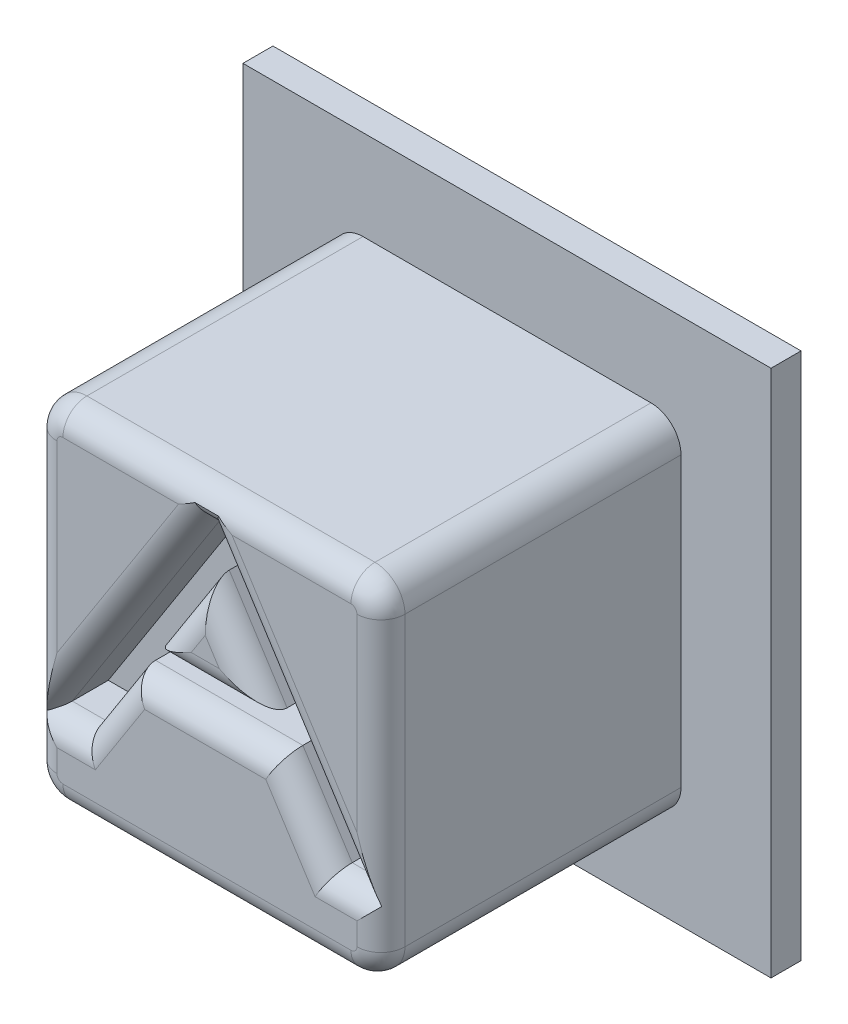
ISO-10303-21;
HEADER;
FILE_DESCRIPTION(('STEP AP214'),'2;1');
FILE_NAME('part.step','',(''),(''),'','','');
FILE_SCHEMA(('AUTOMOTIVE_DESIGN { 1 0 10303 214 1 1 1 1 }'));
ENDSEC;
DATA;
#1=APPLICATION_CONTEXT('core data for automotive mechanical design processes');
#2=APPLICATION_PROTOCOL_DEFINITION('international standard','automotive_design',2000,#1);
#3=PRODUCT_CONTEXT('',#1,'mechanical');
#4=PRODUCT('Part','Part','',(#3));
#5=PRODUCT_RELATED_PRODUCT_CATEGORY('part','',(#4));
#6=PRODUCT_DEFINITION_FORMATION('','',#4);
#7=PRODUCT_DEFINITION_CONTEXT('part definition',#1,'design');
#8=PRODUCT_DEFINITION('design','',#6,#7);
#9=PRODUCT_DEFINITION_SHAPE('','',#8);
#10=(LENGTH_UNIT() NAMED_UNIT(*) SI_UNIT(.MILLI.,.METRE.));
#11=(NAMED_UNIT(*) PLANE_ANGLE_UNIT() SI_UNIT($,.RADIAN.));
#12=(NAMED_UNIT(*) SI_UNIT($,.STERADIAN.) SOLID_ANGLE_UNIT());
#13=UNCERTAINTY_MEASURE_WITH_UNIT(LENGTH_MEASURE(1.E-05),#10,'distance_accuracy_value','');
#14=(GEOMETRIC_REPRESENTATION_CONTEXT(3) GLOBAL_UNCERTAINTY_ASSIGNED_CONTEXT((#13)) GLOBAL_UNIT_ASSIGNED_CONTEXT((#10,
#11,#12)) REPRESENTATION_CONTEXT('',''));
#15=CARTESIAN_POINT('',(0.,0.,0.));
#16=DIRECTION('',(0.,0.,1.));
#17=DIRECTION('',(1.,0.,0.));
#18=AXIS2_PLACEMENT_3D('',#15,#16,#17);
#19=CARTESIAN_POINT('',(0.,0.,5.));
#20=DIRECTION('',(0.,0.,1.));
#21=DIRECTION('',(1.,0.,0.));
#22=AXIS2_PLACEMENT_3D('',#19,#20,#21);
#23=PLANE('',#22);
#24=CARTESIAN_POINT('',(2.4,-2.4,5.));
#25=DIRECTION('',(0.,0.,1.));
#26=DIRECTION('',(1.,0.,0.));
#27=AXIS2_PLACEMENT_3D('',#24,#25,#26);
#28=CIRCLE('',#27,0.1);
#29=CARTESIAN_POINT('',(2.5,-2.4,5.));
#30=VERTEX_POINT('',#29);
#31=CARTESIAN_POINT('',(2.4,-2.5,5.));
#32=VERTEX_POINT('',#31);
#33=EDGE_CURVE('E526',#30,#32,#28,.F.);
#34=ORIENTED_EDGE('',*,*,#33,.F.);
#35=DIRECTION('',(0.,1.,0.));
#36=VECTOR('',#35,1.);
#37=CARTESIAN_POINT('',(2.5,2.9,5.));
#38=LINE('',#37,#36);
#39=CARTESIAN_POINT('',(2.5,-2.02552532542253,5.));
#40=VERTEX_POINT('',#39);
#41=EDGE_CURVE('E417',#30,#40,#38,.T.);
#42=ORIENTED_EDGE('',*,*,#41,.T.);
#43=DIRECTION('',(-1.,0.,0.));
#44=VECTOR('',#43,1.);
#45=CARTESIAN_POINT('',(0.,-2.02552532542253,5.));
#46=LINE('',#45,#44);
#47=CARTESIAN_POINT('',(1.80279833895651,-2.02552532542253,5.));
#48=VERTEX_POINT('',#47);
#49=EDGE_CURVE('E422',#40,#48,#46,.T.);
#50=ORIENTED_EDGE('',*,*,#49,.T.);
#51=DIRECTION('',(-0.539799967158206,0.841793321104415,0.));
#52=VECTOR('',#51,1.);
#53=CARTESIAN_POINT('',(0.357093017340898,0.228985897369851,5.));
#54=LINE('',#53,#52);
#55=CARTESIAN_POINT('',(0.980682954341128,-0.743474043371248,5.));
#56=VERTEX_POINT('',#55);
#57=EDGE_CURVE('E424',#48,#56,#54,.T.);
#58=ORIENTED_EDGE('',*,*,#57,.T.);
#59=DIRECTION('',(-1.,0.,0.));
#60=VECTOR('',#59,1.);
#61=CARTESIAN_POINT('',(0.,-0.743474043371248,5.));
#62=LINE('',#61,#60);
#63=CARTESIAN_POINT('',(-1.03777939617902,-0.743474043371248,5.));
#64=VERTEX_POINT('',#63);
#65=EDGE_CURVE('E426',#56,#64,#62,.T.);
#66=ORIENTED_EDGE('',*,*,#65,.T.);
#67=DIRECTION('',(-0.539426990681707,-0.842032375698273,0.));
#68=VECTOR('',#67,1.);
#69=CARTESIAN_POINT('',(-0.398107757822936,0.255037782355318,5.));
#70=LINE('',#69,#68);
#71=CARTESIAN_POINT('',(-1.85909349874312,-2.02552532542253,5.));
#72=VERTEX_POINT('',#71);
#73=EDGE_CURVE('E428',#64,#72,#70,.T.);
#74=ORIENTED_EDGE('',*,*,#73,.T.);
#75=DIRECTION('',(-1.,0.,0.));
#76=VECTOR('',#75,1.);
#77=CARTESIAN_POINT('',(0.,-2.02552532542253,5.));
#78=LINE('',#77,#76);
#79=CARTESIAN_POINT('',(-2.5,-2.02552532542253,5.));
#80=VERTEX_POINT('',#79);
#81=EDGE_CURVE('E430',#72,#80,#78,.T.);
#82=ORIENTED_EDGE('',*,*,#81,.T.);
#83=DIRECTION('',(0.,-1.,0.));
#84=VECTOR('',#83,1.);
#85=CARTESIAN_POINT('',(-2.5,-2.9,5.));
#86=LINE('',#85,#84);
#87=CARTESIAN_POINT('',(-2.5,-2.4,5.));
#88=VERTEX_POINT('',#87);
#89=EDGE_CURVE('E433',#80,#88,#86,.T.);
#90=ORIENTED_EDGE('',*,*,#89,.T.);
#91=CARTESIAN_POINT('',(-2.4,-2.4,5.));
#92=DIRECTION('',(0.,0.,1.));
#93=DIRECTION('',(1.,0.,0.));
#94=AXIS2_PLACEMENT_3D('',#91,#92,#93);
#95=CIRCLE('',#94,0.1);
#96=CARTESIAN_POINT('',(-2.4,-2.5,5.));
#97=VERTEX_POINT('',#96);
#98=EDGE_CURVE('E523',#97,#88,#95,.F.);
#99=ORIENTED_EDGE('',*,*,#98,.F.);
#100=DIRECTION('',(1.,0.,0.));
#101=VECTOR('',#100,1.);
#102=CARTESIAN_POINT('',(2.9,-2.5,5.));
#103=LINE('',#102,#101);
#104=EDGE_CURVE('E419',#97,#32,#103,.T.);
#105=ORIENTED_EDGE('',*,*,#104,.T.);
#106=EDGE_LOOP('',(#34,#42,#50,#58,#66,#74,#82,#90,#99,#105));
#107=FACE_BOUND('',#106,.T.);
#108=ADVANCED_FACE('F37',(#107),#23,.T.);
#109=CARTESIAN_POINT('',(2.4,2.4,5.));
#110=DIRECTION('',(0.,0.,1.));
#111=DIRECTION('',(1.,0.,0.));
#112=AXIS2_PLACEMENT_3D('',#109,#110,#111);
#113=CIRCLE('',#112,0.1);
#114=CARTESIAN_POINT('',(2.4,2.5,5.));
#115=VERTEX_POINT('',#114);
#116=CARTESIAN_POINT('',(2.5,2.4,5.));
#117=VERTEX_POINT('',#116);
#118=EDGE_CURVE('E521',#115,#117,#113,.F.);
#119=ORIENTED_EDGE('',*,*,#118,.F.);
#120=DIRECTION('',(-1.,0.,0.));
#121=VECTOR('',#120,1.);
#122=CARTESIAN_POINT('',(-2.9,2.5,5.));
#123=LINE('',#122,#121);
#124=CARTESIAN_POINT('',(0.417739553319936,2.5,5.));
#125=VERTEX_POINT('',#124);
#126=EDGE_CURVE('E412',#115,#125,#123,.T.);
#127=ORIENTED_EDGE('',*,*,#126,.T.);
#128=DIRECTION('',(0.539666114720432,-0.841879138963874,0.));
#129=VECTOR('',#128,1.);
#130=CARTESIAN_POINT('',(1.43191139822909,0.917891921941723,5.));
#131=LINE('',#130,#129);
#132=CARTESIAN_POINT('',(2.5,-0.748326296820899,5.));
#133=VERTEX_POINT('',#132);
#134=EDGE_CURVE('E414',#125,#133,#131,.T.);
#135=ORIENTED_EDGE('',*,*,#134,.T.);
#136=DIRECTION('',(0.,1.,0.));
#137=VECTOR('',#136,1.);
#138=CARTESIAN_POINT('',(2.5,2.9,5.));
#139=LINE('',#138,#137);
#140=EDGE_CURVE('E401',#133,#117,#139,.T.);
#141=ORIENTED_EDGE('',*,*,#140,.T.);
#142=EDGE_LOOP('',(#119,#127,#135,#141));
#143=FACE_BOUND('',#142,.T.);
#144=ADVANCED_FACE('F604',(#143),#23,.T.);
#145=CARTESIAN_POINT('',(-2.4,2.4,5.));
#146=DIRECTION('',(0.,0.,1.));
#147=DIRECTION('',(1.,0.,0.));
#148=AXIS2_PLACEMENT_3D('',#145,#146,#147);
#149=CIRCLE('',#148,0.1);
#150=CARTESIAN_POINT('',(-2.5,2.4,5.));
#151=VERTEX_POINT('',#150);
#152=CARTESIAN_POINT('',(-2.4,2.5,5.));
#153=VERTEX_POINT('',#152);
#154=EDGE_CURVE('E514',#151,#153,#149,.F.);
#155=ORIENTED_EDGE('',*,*,#154,.F.);
#156=DIRECTION('',(0.,-1.,0.));
#157=VECTOR('',#156,1.);
#158=CARTESIAN_POINT('',(-2.5,-2.9,5.));
#159=LINE('',#158,#157);
#160=CARTESIAN_POINT('',(-2.5,-0.660326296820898,5.));
#161=VERTEX_POINT('',#160);
#162=EDGE_CURVE('E439',#151,#161,#159,.T.);
#163=ORIENTED_EDGE('',*,*,#162,.T.);
#164=DIRECTION('',(0.539666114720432,0.841879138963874,0.));
#165=VECTOR('',#164,1.);
#166=CARTESIAN_POINT('',(-1.4718927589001,0.943520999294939,5.));
#167=LINE('',#166,#165);
#168=CARTESIAN_POINT('',(-0.474149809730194,2.5,5.));
#169=VERTEX_POINT('',#168);
#170=EDGE_CURVE('E441',#161,#169,#167,.T.);
#171=ORIENTED_EDGE('',*,*,#170,.T.);
#172=DIRECTION('',(-1.,0.,0.));
#173=VECTOR('',#172,1.);
#174=CARTESIAN_POINT('',(-2.9,2.5,5.));
#175=LINE('',#174,#173);
#176=EDGE_CURVE('E436',#169,#153,#175,.T.);
#177=ORIENTED_EDGE('',*,*,#176,.T.);
#178=EDGE_LOOP('',(#155,#163,#171,#177));
#179=FACE_BOUND('',#178,.T.);
#180=ADVANCED_FACE('F610',(#179),#23,.T.);
#181=CARTESIAN_POINT('',(2.9,2.9,5.));
#182=DIRECTION('',(-1.,0.,0.));
#183=DIRECTION('',(0.,-1.,0.));
#184=AXIS2_PLACEMENT_3D('',#181,#182,#183);
#185=PLANE('',#184);
#186=DIRECTION('',(0.,1.,0.));
#187=VECTOR('',#186,1.);
#188=CARTESIAN_POINT('',(2.9,-2.9,4.6));
#189=LINE('',#188,#187);
#190=CARTESIAN_POINT('',(2.9,2.4,4.6));
#191=VERTEX_POINT('',#190);
#192=CARTESIAN_POINT('',(2.9,-2.4,4.6));
#193=VERTEX_POINT('',#192);
#194=EDGE_CURVE('E470',#191,#193,#189,.F.);
#195=ORIENTED_EDGE('',*,*,#194,.T.);
#196=DIRECTION('',(0.,0.,-1.));
#197=VECTOR('',#196,1.);
#198=CARTESIAN_POINT('',(2.9,-2.4,5.));
#199=LINE('',#198,#197);
#200=CARTESIAN_POINT('',(2.9,-2.4,0.));
#201=VERTEX_POINT('',#200);
#202=EDGE_CURVE('E547',#193,#201,#199,.T.);
#203=ORIENTED_EDGE('',*,*,#202,.T.);
#204=DIRECTION('',(0.,1.,0.));
#205=VECTOR('',#204,1.);
#206=CARTESIAN_POINT('',(2.9,2.9,0.));
#207=LINE('',#206,#205);
#208=CARTESIAN_POINT('',(2.9,2.4,0.));
#209=VERTEX_POINT('',#208);
#210=EDGE_CURVE('E371',#201,#209,#207,.T.);
#211=ORIENTED_EDGE('',*,*,#210,.T.);
#212=DIRECTION('',(0.,0.,-1.));
#213=VECTOR('',#212,1.);
#214=CARTESIAN_POINT('',(2.9,2.4,5.));
#215=LINE('',#214,#213);
#216=EDGE_CURVE('E545',#209,#191,#215,.F.);
#217=ORIENTED_EDGE('',*,*,#216,.T.);
#218=EDGE_LOOP('',(#195,#203,#211,#217));
#219=FACE_BOUND('',#218,.T.);
#220=ADVANCED_FACE('F627',(#219),#185,.F.);
#221=CARTESIAN_POINT('',(-2.9,2.9,5.));
#222=DIRECTION('',(0.,-1.,0.));
#223=DIRECTION('',(0.,0.,-1.));
#224=AXIS2_PLACEMENT_3D('',#221,#222,#223);
#225=PLANE('',#224);
#226=DIRECTION('',(-1.,0.,0.));
#227=VECTOR('',#226,1.);
#228=CARTESIAN_POINT('',(2.9,2.9,4.6));
#229=LINE('',#228,#227);
#230=CARTESIAN_POINT('',(-2.4,2.9,4.6));
#231=VERTEX_POINT('',#230);
#232=CARTESIAN_POINT('',(2.4,2.9,4.6));
#233=VERTEX_POINT('',#232);
#234=EDGE_CURVE('E467',#231,#233,#229,.F.);
#235=ORIENTED_EDGE('',*,*,#234,.T.);
#236=DIRECTION('',(0.,0.,-1.));
#237=VECTOR('',#236,1.);
#238=CARTESIAN_POINT('',(2.4,2.9,5.));
#239=LINE('',#238,#237);
#240=CARTESIAN_POINT('',(2.4,2.9,0.));
#241=VERTEX_POINT('',#240);
#242=EDGE_CURVE('E551',#233,#241,#239,.T.);
#243=ORIENTED_EDGE('',*,*,#242,.T.);
#244=DIRECTION('',(-1.,0.,0.));
#245=VECTOR('',#244,1.);
#246=CARTESIAN_POINT('',(-2.9,2.9,0.));
#247=LINE('',#246,#245);
#248=CARTESIAN_POINT('',(-2.4,2.9,0.));
#249=VERTEX_POINT('',#248);
#250=EDGE_CURVE('E374',#241,#249,#247,.T.);
#251=ORIENTED_EDGE('',*,*,#250,.T.);
#252=DIRECTION('',(0.,0.,-1.));
#253=VECTOR('',#252,1.);
#254=CARTESIAN_POINT('',(-2.4,2.9,5.));
#255=LINE('',#254,#253);
#256=EDGE_CURVE('E549',#249,#231,#255,.F.);
#257=ORIENTED_EDGE('',*,*,#256,.T.);
#258=EDGE_LOOP('',(#235,#243,#251,#257));
#259=FACE_BOUND('',#258,.T.);
#260=ADVANCED_FACE('F632',(#259),#225,.F.);
#261=CARTESIAN_POINT('',(-2.9,2.9,5.));
#262=DIRECTION('',(1.,0.,0.));
#263=DIRECTION('',(0.,1.,0.));
#264=AXIS2_PLACEMENT_3D('',#261,#262,#263);
#265=PLANE('',#264);
#266=DIRECTION('',(0.,-1.,0.));
#267=VECTOR('',#266,1.);
#268=CARTESIAN_POINT('',(-2.9,2.9,0.));
#269=LINE('',#268,#267);
#270=CARTESIAN_POINT('',(-2.9,2.4,0.));
#271=VERTEX_POINT('',#270);
#272=CARTESIAN_POINT('',(-2.9,-2.4,0.));
#273=VERTEX_POINT('',#272);
#274=EDGE_CURVE('E377',#271,#273,#269,.T.);
#275=ORIENTED_EDGE('',*,*,#274,.T.);
#276=DIRECTION('',(0.,0.,-1.));
#277=VECTOR('',#276,1.);
#278=CARTESIAN_POINT('',(-2.9,-2.4,5.));
#279=LINE('',#278,#277);
#280=CARTESIAN_POINT('',(-2.9,-2.4,4.6));
#281=VERTEX_POINT('',#280);
#282=EDGE_CURVE('E543',#273,#281,#279,.F.);
#283=ORIENTED_EDGE('',*,*,#282,.T.);
#284=DIRECTION('',(0.,-1.,0.));
#285=VECTOR('',#284,1.);
#286=CARTESIAN_POINT('',(-2.9,2.9,4.6));
#287=LINE('',#286,#285);
#288=CARTESIAN_POINT('',(-2.9,2.4,4.6));
#289=VERTEX_POINT('',#288);
#290=EDGE_CURVE('E464',#281,#289,#287,.F.);
#291=ORIENTED_EDGE('',*,*,#290,.T.);
#292=DIRECTION('',(0.,0.,-1.));
#293=VECTOR('',#292,1.);
#294=CARTESIAN_POINT('',(-2.9,2.4,5.));
#295=LINE('',#294,#293);
#296=EDGE_CURVE('E541',#289,#271,#295,.T.);
#297=ORIENTED_EDGE('',*,*,#296,.T.);
#298=EDGE_LOOP('',(#275,#283,#291,#297));
#299=FACE_BOUND('',#298,.T.);
#300=ADVANCED_FACE('F655',(#299),#265,.F.);
#301=CARTESIAN_POINT('',(-2.9,-2.9,5.));
#302=DIRECTION('',(0.,1.,0.));
#303=DIRECTION('',(0.,0.,1.));
#304=AXIS2_PLACEMENT_3D('',#301,#302,#303);
#305=PLANE('',#304);
#306=DIRECTION('',(1.,0.,0.));
#307=VECTOR('',#306,1.);
#308=CARTESIAN_POINT('',(-2.9,-2.9,4.6));
#309=LINE('',#308,#307);
#310=CARTESIAN_POINT('',(2.4,-2.9,4.6));
#311=VERTEX_POINT('',#310);
#312=CARTESIAN_POINT('',(-2.4,-2.9,4.6));
#313=VERTEX_POINT('',#312);
#314=EDGE_CURVE('E461',#311,#313,#309,.F.);
#315=ORIENTED_EDGE('',*,*,#314,.T.);
#316=DIRECTION('',(0.,0.,-1.));
#317=VECTOR('',#316,1.);
#318=CARTESIAN_POINT('',(-2.4,-2.9,5.));
#319=LINE('',#318,#317);
#320=CARTESIAN_POINT('',(-2.4,-2.9,0.));
#321=VERTEX_POINT('',#320);
#322=EDGE_CURVE('E539',#313,#321,#319,.T.);
#323=ORIENTED_EDGE('',*,*,#322,.T.);
#324=DIRECTION('',(1.,0.,0.));
#325=VECTOR('',#324,1.);
#326=CARTESIAN_POINT('',(-2.9,-2.9,0.));
#327=LINE('',#326,#325);
#328=CARTESIAN_POINT('',(2.4,-2.9,0.));
#329=VERTEX_POINT('',#328);
#330=EDGE_CURVE('E380',#321,#329,#327,.T.);
#331=ORIENTED_EDGE('',*,*,#330,.T.);
#332=DIRECTION('',(0.,0.,-1.));
#333=VECTOR('',#332,1.);
#334=CARTESIAN_POINT('',(2.4,-2.9,5.));
#335=LINE('',#334,#333);
#336=EDGE_CURVE('E537',#329,#311,#335,.F.);
#337=ORIENTED_EDGE('',*,*,#336,.T.);
#338=EDGE_LOOP('',(#315,#323,#331,#337));
#339=FACE_BOUND('',#338,.T.);
#340=ADVANCED_FACE('F680',(#339),#305,.F.);
#341=CARTESIAN_POINT('',(-4.4,4.4,-1.));
#342=DIRECTION('',(0.,-1.,0.));
#343=DIRECTION('',(0.,0.,-1.));
#344=AXIS2_PLACEMENT_3D('',#341,#342,#343);
#345=PLANE('',#344);
#346=DIRECTION('',(0.,0.,1.));
#347=VECTOR('',#346,1.);
#348=CARTESIAN_POINT('',(4.4,4.4,-1.));
#349=LINE('',#348,#347);
#350=CARTESIAN_POINT('',(4.4,4.4,-0.5));
#351=VERTEX_POINT('',#350);
#352=CARTESIAN_POINT('',(4.4,4.4,0.));
#353=VERTEX_POINT('',#352);
#354=EDGE_CURVE('E369',#351,#353,#349,.T.);
#355=ORIENTED_EDGE('',*,*,#354,.F.);
#356=DIRECTION('',(-1.,0.,0.));
#357=VECTOR('',#356,1.);
#358=CARTESIAN_POINT('',(-4.4,4.4,-0.5));
#359=LINE('',#358,#357);
#360=CARTESIAN_POINT('',(-4.4,4.4,-0.5));
#361=VERTEX_POINT('',#360);
#362=EDGE_CURVE('E397',#351,#361,#359,.T.);
#363=ORIENTED_EDGE('',*,*,#362,.T.);
#364=DIRECTION('',(0.,0.,1.));
#365=VECTOR('',#364,1.);
#366=CARTESIAN_POINT('',(-4.4,4.4,-1.));
#367=LINE('',#366,#365);
#368=CARTESIAN_POINT('',(-4.4,4.4,0.));
#369=VERTEX_POINT('',#368);
#370=EDGE_CURVE('E363',#361,#369,#367,.T.);
#371=ORIENTED_EDGE('',*,*,#370,.T.);
#372=DIRECTION('',(1.,0.,0.));
#373=VECTOR('',#372,1.);
#374=CARTESIAN_POINT('',(-4.4,4.4,0.));
#375=LINE('',#374,#373);
#376=EDGE_CURVE('E350',#369,#353,#375,.T.);
#377=ORIENTED_EDGE('',*,*,#376,.T.);
#378=EDGE_LOOP('',(#355,#363,#371,#377));
#379=FACE_BOUND('',#378,.T.);
#380=ADVANCED_FACE('F817',(#379),#345,.F.);
#381=CARTESIAN_POINT('',(4.4,4.4,-1.));
#382=DIRECTION('',(-1.,0.,0.));
#383=DIRECTION('',(0.,-1.,0.));
#384=AXIS2_PLACEMENT_3D('',#381,#382,#383);
#385=PLANE('',#384);
#386=DIRECTION('',(0.,0.,1.));
#387=VECTOR('',#386,1.);
#388=CARTESIAN_POINT('',(4.4,-4.4,-1.));
#389=LINE('',#388,#387);
#390=CARTESIAN_POINT('',(4.4,-4.4,-0.5));
#391=VERTEX_POINT('',#390);
#392=CARTESIAN_POINT('',(4.4,-4.4,0.));
#393=VERTEX_POINT('',#392);
#394=EDGE_CURVE('E367',#391,#393,#389,.T.);
#395=ORIENTED_EDGE('',*,*,#394,.F.);
#396=DIRECTION('',(0.,1.,0.));
#397=VECTOR('',#396,1.);
#398=CARTESIAN_POINT('',(4.4,4.4,-0.5));
#399=LINE('',#398,#397);
#400=EDGE_CURVE('E399',#391,#351,#399,.T.);
#401=ORIENTED_EDGE('',*,*,#400,.T.);
#402=ORIENTED_EDGE('',*,*,#354,.T.);
#403=DIRECTION('',(0.,-1.,0.));
#404=VECTOR('',#403,1.);
#405=CARTESIAN_POINT('',(4.4,4.4,0.));
#406=LINE('',#405,#404);
#407=EDGE_CURVE('E353',#353,#393,#406,.T.);
#408=ORIENTED_EDGE('',*,*,#407,.T.);
#409=EDGE_LOOP('',(#395,#401,#402,#408));
#410=FACE_BOUND('',#409,.T.);
#411=ADVANCED_FACE('F814',(#410),#385,.F.);
#412=CARTESIAN_POINT('',(4.4,-4.4,-1.));
#413=DIRECTION('',(0.,1.,0.));
#414=DIRECTION('',(0.,0.,1.));
#415=AXIS2_PLACEMENT_3D('',#412,#413,#414);
#416=PLANE('',#415);
#417=DIRECTION('',(0.,0.,1.));
#418=VECTOR('',#417,1.);
#419=CARTESIAN_POINT('',(-4.4,-4.4,-1.));
#420=LINE('',#419,#418);
#421=CARTESIAN_POINT('',(-4.4,-4.4,-0.5));
#422=VERTEX_POINT('',#421);
#423=CARTESIAN_POINT('',(-4.4,-4.4,0.));
#424=VERTEX_POINT('',#423);
#425=EDGE_CURVE('E365',#422,#424,#420,.T.);
#426=ORIENTED_EDGE('',*,*,#425,.F.);
#427=DIRECTION('',(1.,0.,0.));
#428=VECTOR('',#427,1.);
#429=CARTESIAN_POINT('',(4.4,-4.4,-0.5));
#430=LINE('',#429,#428);
#431=EDGE_CURVE('E392',#422,#391,#430,.T.);
#432=ORIENTED_EDGE('',*,*,#431,.T.);
#433=ORIENTED_EDGE('',*,*,#394,.T.);
#434=DIRECTION('',(-1.,0.,0.));
#435=VECTOR('',#434,1.);
#436=CARTESIAN_POINT('',(4.4,-4.4,0.));
#437=LINE('',#436,#435);
#438=EDGE_CURVE('E357',#393,#424,#437,.T.);
#439=ORIENTED_EDGE('',*,*,#438,.T.);
#440=EDGE_LOOP('',(#426,#432,#433,#439));
#441=FACE_BOUND('',#440,.T.);
#442=ADVANCED_FACE('F810',(#441),#416,.F.);
#443=CARTESIAN_POINT('',(-4.4,-4.4,-1.));
#444=DIRECTION('',(1.,0.,0.));
#445=DIRECTION('',(0.,1.,0.));
#446=AXIS2_PLACEMENT_3D('',#443,#444,#445);
#447=PLANE('',#446);
#448=ORIENTED_EDGE('',*,*,#370,.F.);
#449=DIRECTION('',(0.,-1.,0.));
#450=VECTOR('',#449,1.);
#451=CARTESIAN_POINT('',(-4.4,-4.4,-0.5));
#452=LINE('',#451,#450);
#453=EDGE_CURVE('E395',#361,#422,#452,.T.);
#454=ORIENTED_EDGE('',*,*,#453,.T.);
#455=ORIENTED_EDGE('',*,*,#425,.T.);
#456=DIRECTION('',(0.,1.,0.));
#457=VECTOR('',#456,1.);
#458=CARTESIAN_POINT('',(-4.4,-4.4,0.));
#459=LINE('',#458,#457);
#460=EDGE_CURVE('E360',#424,#369,#459,.T.);
#461=ORIENTED_EDGE('',*,*,#460,.T.);
#462=EDGE_LOOP('',(#448,#454,#455,#461));
#463=FACE_BOUND('',#462,.T.);
#464=ADVANCED_FACE('F803',(#463),#447,.F.);
#465=CARTESIAN_POINT('',(0.,0.,-1.));
#466=DIRECTION('',(0.,0.,-1.));
#467=DIRECTION('',(-1.,0.,0.));
#468=AXIS2_PLACEMENT_3D('',#465,#466,#467);
#469=PLANE('',#468);
#470=DIRECTION('',(0.,-1.,0.));
#471=VECTOR('',#470,1.);
#472=CARTESIAN_POINT('',(3.9,-4.4,-1.));
#473=LINE('',#472,#471);
#474=CARTESIAN_POINT('',(3.9,3.9,-1.));
#475=VERTEX_POINT('',#474);
#476=CARTESIAN_POINT('',(3.9,-3.9,-1.));
#477=VERTEX_POINT('',#476);
#478=EDGE_CURVE('E383',#475,#477,#473,.T.);
#479=ORIENTED_EDGE('',*,*,#478,.T.);
#480=DIRECTION('',(-1.,0.,0.));
#481=VECTOR('',#480,1.);
#482=CARTESIAN_POINT('',(-4.4,-3.9,-1.));
#483=LINE('',#482,#481);
#484=CARTESIAN_POINT('',(-3.9,-3.9,-1.));
#485=VERTEX_POINT('',#484);
#486=EDGE_CURVE('E389',#477,#485,#483,.T.);
#487=ORIENTED_EDGE('',*,*,#486,.T.);
#488=DIRECTION('',(0.,1.,0.));
#489=VECTOR('',#488,1.);
#490=CARTESIAN_POINT('',(-3.9,4.4,-1.));
#491=LINE('',#490,#489);
#492=CARTESIAN_POINT('',(-3.9,3.9,-1.));
#493=VERTEX_POINT('',#492);
#494=EDGE_CURVE('E387',#485,#493,#491,.T.);
#495=ORIENTED_EDGE('',*,*,#494,.T.);
#496=DIRECTION('',(1.,0.,0.));
#497=VECTOR('',#496,1.);
#498=CARTESIAN_POINT('',(4.4,3.9,-1.));
#499=LINE('',#498,#497);
#500=EDGE_CURVE('E385',#493,#475,#499,.T.);
#501=ORIENTED_EDGE('',*,*,#500,.T.);
#502=EDGE_LOOP('',(#479,#487,#495,#501));
#503=FACE_BOUND('',#502,.T.);
#504=ADVANCED_FACE('F800',(#503),#469,.T.);
#505=CARTESIAN_POINT('',(0.,0.,0.));
#506=DIRECTION('',(0.,0.,-1.));
#507=DIRECTION('',(-1.,0.,0.));
#508=AXIS2_PLACEMENT_3D('',#505,#506,#507);
#509=PLANE('',#508);
#510=ORIENTED_EDGE('',*,*,#210,.F.);
#511=CARTESIAN_POINT('',(2.4,-2.4,0.));
#512=DIRECTION('',(0.,0.,-1.));
#513=DIRECTION('',(-1.,0.,0.));
#514=AXIS2_PLACEMENT_3D('',#511,#512,#513);
#515=CIRCLE('',#514,0.5);
#516=EDGE_CURVE('E555',#201,#329,#515,.T.);
#517=ORIENTED_EDGE('',*,*,#516,.T.);
#518=ORIENTED_EDGE('',*,*,#330,.F.);
#519=CARTESIAN_POINT('',(-2.4,-2.4,0.));
#520=DIRECTION('',(0.,0.,-1.));
#521=DIRECTION('',(-1.,0.,0.));
#522=AXIS2_PLACEMENT_3D('',#519,#520,#521);
#523=CIRCLE('',#522,0.5);
#524=EDGE_CURVE('E553',#321,#273,#523,.T.);
#525=ORIENTED_EDGE('',*,*,#524,.T.);
#526=ORIENTED_EDGE('',*,*,#274,.F.);
#527=CARTESIAN_POINT('',(-2.4,2.4,0.));
#528=DIRECTION('',(0.,0.,-1.));
#529=DIRECTION('',(-1.,0.,0.));
#530=AXIS2_PLACEMENT_3D('',#527,#528,#529);
#531=CIRCLE('',#530,0.5);
#532=EDGE_CURVE('E559',#271,#249,#531,.T.);
#533=ORIENTED_EDGE('',*,*,#532,.T.);
#534=ORIENTED_EDGE('',*,*,#250,.F.);
#535=CARTESIAN_POINT('',(2.4,2.4,0.));
#536=DIRECTION('',(0.,0.,-1.));
#537=DIRECTION('',(-1.,0.,0.));
#538=AXIS2_PLACEMENT_3D('',#535,#536,#537);
#539=CIRCLE('',#538,0.5);
#540=EDGE_CURVE('E557',#241,#209,#539,.T.);
#541=ORIENTED_EDGE('',*,*,#540,.T.);
#542=EDGE_LOOP('',(#510,#517,#518,#525,#526,#533,#534,#541));
#543=FACE_BOUND('',#542,.T.);
#544=ORIENTED_EDGE('',*,*,#376,.F.);
#545=ORIENTED_EDGE('',*,*,#460,.F.);
#546=ORIENTED_EDGE('',*,*,#438,.F.);
#547=ORIENTED_EDGE('',*,*,#407,.F.);
#548=EDGE_LOOP('',(#544,#545,#546,#547));
#549=FACE_BOUND('',#548,.T.);
#550=ADVANCED_FACE('F659',(#543,#549),#509,.F.);
#551=CARTESIAN_POINT('',(0.,3.9,-1.));
#552=DIRECTION('',(0.,0.707106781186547,-0.707106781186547));
#553=DIRECTION('',(-1.,0.,0.));
#554=AXIS2_PLACEMENT_3D('',#551,#552,#553);
#555=PLANE('',#554);
#556=DIRECTION('',(-0.577350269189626,0.577350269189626,0.577350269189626));
#557=VECTOR('',#556,1.);
#558=CARTESIAN_POINT('',(-2.6,2.6,-2.3));
#559=LINE('',#558,#557);
#560=EDGE_CURVE('E405',#361,#493,#559,.F.);
#561=ORIENTED_EDGE('',*,*,#560,.F.);
#562=ORIENTED_EDGE('',*,*,#362,.F.);
#563=DIRECTION('',(0.577350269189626,0.577350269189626,0.577350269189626));
#564=VECTOR('',#563,1.);
#565=CARTESIAN_POINT('',(2.6,2.6,-2.3));
#566=LINE('',#565,#564);
#567=EDGE_CURVE('E354',#475,#351,#566,.T.);
#568=ORIENTED_EDGE('',*,*,#567,.F.);
#569=ORIENTED_EDGE('',*,*,#500,.F.);
#570=EDGE_LOOP('',(#561,#562,#568,#569));
#571=FACE_BOUND('',#570,.T.);
#572=ADVANCED_FACE('F807',(#571),#555,.T.);
#573=CARTESIAN_POINT('',(3.9,0.,-1.));
#574=DIRECTION('',(0.707106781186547,0.,-0.707106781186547));
#575=DIRECTION('',(0.,1.,0.));
#576=AXIS2_PLACEMENT_3D('',#573,#574,#575);
#577=PLANE('',#576);
#578=ORIENTED_EDGE('',*,*,#567,.T.);
#579=ORIENTED_EDGE('',*,*,#400,.F.);
#580=DIRECTION('',(-0.577350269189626,0.577350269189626,-0.577350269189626));
#581=VECTOR('',#580,1.);
#582=CARTESIAN_POINT('',(2.6,-2.6,-2.3));
#583=LINE('',#582,#581);
#584=EDGE_CURVE('E403',#477,#391,#583,.F.);
#585=ORIENTED_EDGE('',*,*,#584,.F.);
#586=ORIENTED_EDGE('',*,*,#478,.F.);
#587=EDGE_LOOP('',(#578,#579,#585,#586));
#588=FACE_BOUND('',#587,.T.);
#589=ADVANCED_FACE('F837',(#588),#577,.T.);
#590=CARTESIAN_POINT('',(-3.9,0.,-1.));
#591=DIRECTION('',(-0.707106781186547,0.,-0.707106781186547));
#592=DIRECTION('',(0.,-1.,0.));
#593=AXIS2_PLACEMENT_3D('',#590,#591,#592);
#594=PLANE('',#593);
#595=ORIENTED_EDGE('',*,*,#560,.T.);
#596=ORIENTED_EDGE('',*,*,#494,.F.);
#597=DIRECTION('',(-0.577350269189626,-0.577350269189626,0.577350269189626));
#598=VECTOR('',#597,1.);
#599=CARTESIAN_POINT('',(-2.6,-2.6,-2.3));
#600=LINE('',#599,#598);
#601=EDGE_CURVE('E349',#422,#485,#600,.F.);
#602=ORIENTED_EDGE('',*,*,#601,.F.);
#603=ORIENTED_EDGE('',*,*,#453,.F.);
#604=EDGE_LOOP('',(#595,#596,#602,#603));
#605=FACE_BOUND('',#604,.T.);
#606=ADVANCED_FACE('F842',(#605),#594,.T.);
#607=CARTESIAN_POINT('',(0.,-3.9,-1.));
#608=DIRECTION('',(0.,-0.707106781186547,-0.707106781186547));
#609=DIRECTION('',(1.,0.,0.));
#610=AXIS2_PLACEMENT_3D('',#607,#608,#609);
#611=PLANE('',#610);
#612=ORIENTED_EDGE('',*,*,#584,.T.);
#613=ORIENTED_EDGE('',*,*,#431,.F.);
#614=ORIENTED_EDGE('',*,*,#601,.T.);
#615=ORIENTED_EDGE('',*,*,#486,.F.);
#616=EDGE_LOOP('',(#612,#613,#614,#615));
#617=FACE_BOUND('',#616,.T.);
#618=ADVANCED_FACE('F799',(#617),#611,.T.);
#619=CARTESIAN_POINT('',(-0.0794871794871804,2.37447467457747,4.));
#620=DIRECTION('',(0.,-1.,0.));
#621=DIRECTION('',(0.,0.,-1.));
#622=AXIS2_PLACEMENT_3D('',#619,#620,#621);
#623=PLANE('',#622);
#624=DIRECTION('',(0.,0.,1.));
#625=VECTOR('',#624,1.);
#626=CARTESIAN_POINT('',(0.0230769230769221,2.37447467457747,4.));
#627=LINE('',#626,#625);
#628=CARTESIAN_POINT('',(0.0230769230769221,2.37447467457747,4.));
#629=VERTEX_POINT('',#628);
#630=CARTESIAN_POINT('',(0.0230769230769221,2.37447467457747,4.6));
#631=VERTEX_POINT('',#630);
#632=EDGE_CURVE('E346',#629,#631,#627,.T.);
#633=ORIENTED_EDGE('',*,*,#632,.T.);
#634=DIRECTION('',(1.,0.,0.));
#635=VECTOR('',#634,1.);
#636=CARTESIAN_POINT('',(-0.0794871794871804,2.37447467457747,4.6));
#637=LINE('',#636,#635);
#638=CARTESIAN_POINT('',(-0.0794871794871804,2.37447467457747,4.6));
#639=VERTEX_POINT('',#638);
#640=EDGE_CURVE('E457',#631,#639,#637,.F.);
#641=ORIENTED_EDGE('',*,*,#640,.T.);
#642=DIRECTION('',(0.,0.,1.));
#643=VECTOR('',#642,1.);
#644=CARTESIAN_POINT('',(-0.0794871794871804,2.37447467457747,4.));
#645=LINE('',#644,#643);
#646=CARTESIAN_POINT('',(-0.0794871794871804,2.37447467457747,4.));
#647=VERTEX_POINT('',#646);
#648=EDGE_CURVE('E325',#647,#639,#645,.T.);
#649=ORIENTED_EDGE('',*,*,#648,.F.);
#650=DIRECTION('',(1.,0.,0.));
#651=VECTOR('',#650,1.);
#652=CARTESIAN_POINT('',(-0.0794871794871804,2.37447467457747,4.));
#653=LINE('',#652,#651);
#654=EDGE_CURVE('E307',#647,#629,#653,.T.);
#655=ORIENTED_EDGE('',*,*,#654,.T.);
#656=EDGE_LOOP('',(#633,#641,#649,#655));
#657=FACE_BOUND('',#656,.T.);
#658=ADVANCED_FACE('F751',(#657),#623,.T.);
#659=CARTESIAN_POINT('',(0.0230769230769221,2.37447467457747,4.));
#660=DIRECTION('',(-0.841879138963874,-0.539666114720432,0.));
#661=DIRECTION('',(0.539666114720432,-0.841879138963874,0.));
#662=AXIS2_PLACEMENT_3D('',#659,#660,#661);
#663=PLANE('',#662);
#664=DIRECTION('',(0.,0.,1.));
#665=VECTOR('',#664,1.);
#666=CARTESIAN_POINT('',(2.58717948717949,-1.62552532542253,4.));
#667=LINE('',#666,#665);
#668=CARTESIAN_POINT('',(2.58717948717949,-1.62552532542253,4.));
#669=VERTEX_POINT('',#668);
#670=CARTESIAN_POINT('',(2.58717948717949,-1.62552532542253,4.6));
#671=VERTEX_POINT('',#670);
#672=EDGE_CURVE('E343',#669,#671,#667,.T.);
#673=ORIENTED_EDGE('',*,*,#672,.T.);
#674=DIRECTION('',(0.539666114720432,-0.841879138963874,0.));
#675=VECTOR('',#674,1.);
#676=CARTESIAN_POINT('',(0.0230769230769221,2.37447467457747,4.6));
#677=LINE('',#676,#675);
#678=EDGE_CURVE('E455',#671,#631,#677,.F.);
#679=ORIENTED_EDGE('',*,*,#678,.T.);
#680=ORIENTED_EDGE('',*,*,#632,.F.);
#681=DIRECTION('',(0.539666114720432,-0.841879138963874,0.));
#682=VECTOR('',#681,1.);
#683=CARTESIAN_POINT('',(0.0230769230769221,2.37447467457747,4.));
#684=LINE('',#683,#682);
#685=EDGE_CURVE('E311',#629,#669,#684,.T.);
#686=ORIENTED_EDGE('',*,*,#685,.T.);
#687=EDGE_LOOP('',(#673,#679,#680,#686));
#688=FACE_BOUND('',#687,.T.);
#689=ADVANCED_FACE('F748',(#688),#663,.T.);
#690=CARTESIAN_POINT('',(2.58717948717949,-1.62552532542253,4.));
#691=DIRECTION('',(0.,1.,0.));
#692=DIRECTION('',(0.,0.,1.));
#693=AXIS2_PLACEMENT_3D('',#690,#691,#692);
#694=PLANE('',#693);
#695=DIRECTION('',(0.,0.,1.));
#696=VECTOR('',#695,1.);
#697=CARTESIAN_POINT('',(2.02147435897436,-1.62552532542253,4.));
#698=LINE('',#697,#696);
#699=CARTESIAN_POINT('',(2.02147435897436,-1.62552532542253,4.));
#700=VERTEX_POINT('',#699);
#701=CARTESIAN_POINT('',(2.02147435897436,-1.62552532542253,4.6));
#702=VERTEX_POINT('',#701);
#703=EDGE_CURVE('E340',#700,#702,#698,.T.);
#704=ORIENTED_EDGE('',*,*,#703,.T.);
#705=DIRECTION('',(-1.,0.,0.));
#706=VECTOR('',#705,1.);
#707=CARTESIAN_POINT('',(2.58717948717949,-1.62552532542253,4.6));
#708=LINE('',#707,#706);
#709=EDGE_CURVE('E453',#702,#671,#708,.F.);
#710=ORIENTED_EDGE('',*,*,#709,.T.);
#711=ORIENTED_EDGE('',*,*,#672,.F.);
#712=DIRECTION('',(-1.,0.,0.));
#713=VECTOR('',#712,1.);
#714=CARTESIAN_POINT('',(2.58717948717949,-1.62552532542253,4.));
#715=LINE('',#714,#713);
#716=EDGE_CURVE('E313',#669,#700,#715,.T.);
#717=ORIENTED_EDGE('',*,*,#716,.T.);
#718=EDGE_LOOP('',(#704,#710,#711,#717));
#719=FACE_BOUND('',#718,.T.);
#720=ADVANCED_FACE('F759',(#719),#694,.T.);
#721=CARTESIAN_POINT('',(2.02147435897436,-1.62552532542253,4.));
#722=DIRECTION('',(0.841793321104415,0.539799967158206,0.));
#723=DIRECTION('',(-0.539799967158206,0.841793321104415,0.));
#724=AXIS2_PLACEMENT_3D('',#721,#722,#723);
#725=PLANE('',#724);
#726=DIRECTION('',(0.,0.,1.));
#727=VECTOR('',#726,1.);
#728=CARTESIAN_POINT('',(1.19935897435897,-0.343474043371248,4.));
#729=LINE('',#728,#727);
#730=CARTESIAN_POINT('',(1.19935897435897,-0.343474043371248,4.));
#731=VERTEX_POINT('',#730);
#732=CARTESIAN_POINT('',(1.19935897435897,-0.343474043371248,4.6));
#733=VERTEX_POINT('',#732);
#734=EDGE_CURVE('E337',#731,#733,#729,.T.);
#735=ORIENTED_EDGE('',*,*,#734,.T.);
#736=DIRECTION('',(-0.539799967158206,0.841793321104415,0.));
#737=VECTOR('',#736,1.);
#738=CARTESIAN_POINT('',(2.02147435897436,-1.62552532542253,4.6));
#739=LINE('',#738,#737);
#740=EDGE_CURVE('E451',#733,#702,#739,.F.);
#741=ORIENTED_EDGE('',*,*,#740,.T.);
#742=ORIENTED_EDGE('',*,*,#703,.F.);
#743=DIRECTION('',(-0.539799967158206,0.841793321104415,0.));
#744=VECTOR('',#743,1.);
#745=CARTESIAN_POINT('',(2.02147435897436,-1.62552532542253,4.));
#746=LINE('',#745,#744);
#747=EDGE_CURVE('E315',#700,#731,#746,.T.);
#748=ORIENTED_EDGE('',*,*,#747,.T.);
#749=EDGE_LOOP('',(#735,#741,#742,#748));
#750=FACE_BOUND('',#749,.T.);
#751=ADVANCED_FACE('F762',(#750),#725,.T.);
#752=CARTESIAN_POINT('',(1.19935897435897,-0.343474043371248,4.));
#753=DIRECTION('',(0.,1.,0.));
#754=DIRECTION('',(0.,0.,1.));
#755=AXIS2_PLACEMENT_3D('',#752,#753,#754);
#756=PLANE('',#755);
#757=DIRECTION('',(0.,0.,1.));
#758=VECTOR('',#757,1.);
#759=CARTESIAN_POINT('',(-1.25657051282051,-0.343474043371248,4.));
#760=LINE('',#759,#758);
#761=CARTESIAN_POINT('',(-1.25657051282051,-0.343474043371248,4.));
#762=VERTEX_POINT('',#761);
#763=CARTESIAN_POINT('',(-1.25657051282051,-0.343474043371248,4.6));
#764=VERTEX_POINT('',#763);
#765=EDGE_CURVE('E334',#762,#764,#760,.T.);
#766=ORIENTED_EDGE('',*,*,#765,.T.);
#767=DIRECTION('',(-1.,0.,0.));
#768=VECTOR('',#767,1.);
#769=CARTESIAN_POINT('',(1.19935897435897,-0.343474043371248,4.6));
#770=LINE('',#769,#768);
#771=EDGE_CURVE('E449',#764,#733,#770,.F.);
#772=ORIENTED_EDGE('',*,*,#771,.T.);
#773=ORIENTED_EDGE('',*,*,#734,.F.);
#774=DIRECTION('',(-1.,0.,0.));
#775=VECTOR('',#774,1.);
#776=CARTESIAN_POINT('',(1.19935897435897,-0.343474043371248,4.));
#777=LINE('',#776,#775);
#778=EDGE_CURVE('E317',#731,#762,#777,.T.);
#779=ORIENTED_EDGE('',*,*,#778,.T.);
#780=EDGE_LOOP('',(#766,#772,#773,#779));
#781=FACE_BOUND('',#780,.T.);
#782=ADVANCED_FACE('F768',(#781),#756,.T.);
#783=CARTESIAN_POINT('',(-1.25657051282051,-0.343474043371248,4.));
#784=DIRECTION('',(-0.842032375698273,0.539426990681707,0.));
#785=DIRECTION('',(-0.539426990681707,-0.842032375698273,0.));
#786=AXIS2_PLACEMENT_3D('',#783,#784,#785);
#787=PLANE('',#786);
#788=DIRECTION('',(0.,0.,1.));
#789=VECTOR('',#788,1.);
#790=CARTESIAN_POINT('',(-2.07788461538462,-1.62552532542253,4.));
#791=LINE('',#790,#789);
#792=CARTESIAN_POINT('',(-2.07788461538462,-1.62552532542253,4.));
#793=VERTEX_POINT('',#792);
#794=CARTESIAN_POINT('',(-2.07788461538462,-1.62552532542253,4.6));
#795=VERTEX_POINT('',#794);
#796=EDGE_CURVE('E331',#793,#795,#791,.T.);
#797=ORIENTED_EDGE('',*,*,#796,.T.);
#798=DIRECTION('',(-0.539426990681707,-0.842032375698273,0.));
#799=VECTOR('',#798,1.);
#800=CARTESIAN_POINT('',(-1.25657051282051,-0.343474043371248,4.6));
#801=LINE('',#800,#799);
#802=EDGE_CURVE('E447',#795,#764,#801,.F.);
#803=ORIENTED_EDGE('',*,*,#802,.T.);
#804=ORIENTED_EDGE('',*,*,#765,.F.);
#805=DIRECTION('',(-0.539426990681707,-0.842032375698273,0.));
#806=VECTOR('',#805,1.);
#807=CARTESIAN_POINT('',(-1.25657051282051,-0.343474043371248,4.));
#808=LINE('',#807,#806);
#809=EDGE_CURVE('E319',#762,#793,#808,.T.);
#810=ORIENTED_EDGE('',*,*,#809,.T.);
#811=EDGE_LOOP('',(#797,#803,#804,#810));
#812=FACE_BOUND('',#811,.T.);
#813=ADVANCED_FACE('F770',(#812),#787,.T.);
#814=CARTESIAN_POINT('',(-2.07788461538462,-1.62552532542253,4.));
#815=DIRECTION('',(0.,1.,0.));
#816=DIRECTION('',(0.,0.,1.));
#817=AXIS2_PLACEMENT_3D('',#814,#815,#816);
#818=PLANE('',#817);
#819=DIRECTION('',(0.,0.,1.));
#820=VECTOR('',#819,1.);
#821=CARTESIAN_POINT('',(-2.64358974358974,-1.62552532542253,4.));
#822=LINE('',#821,#820);
#823=CARTESIAN_POINT('',(-2.64358974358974,-1.62552532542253,4.));
#824=VERTEX_POINT('',#823);
#825=CARTESIAN_POINT('',(-2.64358974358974,-1.62552532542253,4.6));
#826=VERTEX_POINT('',#825);
#827=EDGE_CURVE('E328',#824,#826,#822,.T.);
#828=ORIENTED_EDGE('',*,*,#827,.T.);
#829=DIRECTION('',(-1.,0.,0.));
#830=VECTOR('',#829,1.);
#831=CARTESIAN_POINT('',(-2.07788461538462,-1.62552532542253,4.6));
#832=LINE('',#831,#830);
#833=EDGE_CURVE('E444',#826,#795,#832,.F.);
#834=ORIENTED_EDGE('',*,*,#833,.T.);
#835=ORIENTED_EDGE('',*,*,#796,.F.);
#836=DIRECTION('',(-1.,0.,0.));
#837=VECTOR('',#836,1.);
#838=CARTESIAN_POINT('',(-2.07788461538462,-1.62552532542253,4.));
#839=LINE('',#838,#837);
#840=EDGE_CURVE('E321',#793,#824,#839,.T.);
#841=ORIENTED_EDGE('',*,*,#840,.T.);
#842=EDGE_LOOP('',(#828,#834,#835,#841));
#843=FACE_BOUND('',#842,.T.);
#844=ADVANCED_FACE('F773',(#843),#818,.T.);
#845=CARTESIAN_POINT('',(-2.64358974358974,-1.62552532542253,4.));
#846=DIRECTION('',(0.841879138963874,-0.539666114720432,0.));
#847=DIRECTION('',(0.539666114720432,0.841879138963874,0.));
#848=AXIS2_PLACEMENT_3D('',#845,#846,#847);
#849=PLANE('',#848);
#850=ORIENTED_EDGE('',*,*,#648,.T.);
#851=DIRECTION('',(0.539666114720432,0.841879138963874,0.));
#852=VECTOR('',#851,1.);
#853=CARTESIAN_POINT('',(-2.64358974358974,-1.62552532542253,4.6));
#854=LINE('',#853,#852);
#855=EDGE_CURVE('E459',#639,#826,#854,.F.);
#856=ORIENTED_EDGE('',*,*,#855,.T.);
#857=ORIENTED_EDGE('',*,*,#827,.F.);
#858=DIRECTION('',(0.539666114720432,0.841879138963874,0.));
#859=VECTOR('',#858,1.);
#860=CARTESIAN_POINT('',(-2.64358974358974,-1.62552532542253,4.));
#861=LINE('',#860,#859);
#862=EDGE_CURVE('E323',#824,#647,#861,.T.);
#863=ORIENTED_EDGE('',*,*,#862,.T.);
#864=EDGE_LOOP('',(#850,#856,#857,#863));
#865=FACE_BOUND('',#864,.T.);
#866=ADVANCED_FACE('F776',(#865),#849,.T.);
#867=CARTESIAN_POINT('',(0.,0.,4.));
#868=DIRECTION('',(0.,0.,-1.));
#869=DIRECTION('',(-1.,0.,0.));
#870=AXIS2_PLACEMENT_3D('',#867,#868,#869);
#871=PLANE('',#870);
#872=DIRECTION('',(-0.539511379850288,0.841978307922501,0.));
#873=VECTOR('',#872,1.);
#874=CARTESIAN_POINT('',(0.936538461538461,0.0667823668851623,4.));
#875=LINE('',#874,#873);
#876=CARTESIAN_POINT('',(0.936538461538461,0.0667823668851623,4.));
#877=VERTEX_POINT('',#876);
#878=CARTESIAN_POINT('',(-0.0282051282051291,1.57239134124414,4.));
#879=VERTEX_POINT('',#878);
#880=EDGE_CURVE('E294',#877,#879,#875,.T.);
#881=ORIENTED_EDGE('',*,*,#880,.F.);
#882=DIRECTION('',(1.,0.,0.));
#883=VECTOR('',#882,1.);
#884=CARTESIAN_POINT('',(-0.992948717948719,0.0667823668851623,4.));
#885=LINE('',#884,#883);
#886=CARTESIAN_POINT('',(-0.992948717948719,0.0667823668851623,4.));
#887=VERTEX_POINT('',#886);
#888=EDGE_CURVE('E288',#887,#877,#885,.T.);
#889=ORIENTED_EDGE('',*,*,#888,.F.);
#890=DIRECTION('',(-0.539511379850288,-0.841978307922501,0.));
#891=VECTOR('',#890,1.);
#892=CARTESIAN_POINT('',(-0.0282051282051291,1.57239134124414,4.));
#893=LINE('',#892,#891);
#894=EDGE_CURVE('E283',#879,#887,#893,.T.);
#895=ORIENTED_EDGE('',*,*,#894,.F.);
#896=EDGE_LOOP('',(#881,#889,#895));
#897=FACE_BOUND('',#896,.T.);
#898=ORIENTED_EDGE('',*,*,#654,.F.);
#899=ORIENTED_EDGE('',*,*,#862,.F.);
#900=ORIENTED_EDGE('',*,*,#840,.F.);
#901=ORIENTED_EDGE('',*,*,#809,.F.);
#902=ORIENTED_EDGE('',*,*,#778,.F.);
#903=ORIENTED_EDGE('',*,*,#747,.F.);
#904=ORIENTED_EDGE('',*,*,#716,.F.);
#905=ORIENTED_EDGE('',*,*,#685,.F.);
#906=EDGE_LOOP('',(#898,#899,#900,#901,#902,#903,#904,#905));
#907=FACE_BOUND('',#906,.T.);
#908=ADVANCED_FACE('F292',(#897,#907),#871,.F.);
#909=CARTESIAN_POINT('',(0.936538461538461,0.0667823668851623,4.));
#910=DIRECTION('',(0.841978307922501,0.539511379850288,0.));
#911=DIRECTION('',(-0.539511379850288,0.841978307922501,0.));
#912=AXIS2_PLACEMENT_3D('',#909,#910,#911);
#913=PLANE('',#912);
#914=DIRECTION('',(0.,0.,1.));
#915=VECTOR('',#914,1.);
#916=CARTESIAN_POINT('',(-0.0282051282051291,1.57239134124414,4.));
#917=LINE('',#916,#915);
#918=CARTESIAN_POINT('',(-0.0282051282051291,1.57239134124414,4.6));
#919=VERTEX_POINT('',#918);
#920=EDGE_CURVE('E280',#879,#919,#917,.T.);
#921=ORIENTED_EDGE('',*,*,#920,.T.);
#922=DIRECTION('',(-0.539511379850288,0.841978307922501,0.));
#923=VECTOR('',#922,1.);
#924=CARTESIAN_POINT('',(0.936538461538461,0.0667823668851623,4.6));
#925=LINE('',#924,#923);
#926=CARTESIAN_POINT('',(0.936538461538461,0.0667823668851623,4.6));
#927=VERTEX_POINT('',#926);
#928=EDGE_CURVE('E46',#919,#927,#925,.F.);
#929=ORIENTED_EDGE('',*,*,#928,.T.);
#930=DIRECTION('',(0.,0.,1.));
#931=VECTOR('',#930,1.);
#932=CARTESIAN_POINT('',(0.936538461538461,0.0667823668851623,4.));
#933=LINE('',#932,#931);
#934=EDGE_CURVE('E298',#877,#927,#933,.T.);
#935=ORIENTED_EDGE('',*,*,#934,.F.);
#936=ORIENTED_EDGE('',*,*,#880,.T.);
#937=EDGE_LOOP('',(#921,#929,#935,#936));
#938=FACE_BOUND('',#937,.T.);
#939=ADVANCED_FACE('F297',(#938),#913,.T.);
#940=CARTESIAN_POINT('',(-0.992948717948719,0.0667823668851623,4.));
#941=DIRECTION('',(0.,-1.,0.));
#942=DIRECTION('',(0.,0.,-1.));
#943=AXIS2_PLACEMENT_3D('',#940,#941,#942);
#944=PLANE('',#943);
#945=ORIENTED_EDGE('',*,*,#934,.T.);
#946=DIRECTION('',(1.,0.,0.));
#947=VECTOR('',#946,1.);
#948=CARTESIAN_POINT('',(-0.992948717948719,0.0667823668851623,4.6));
#949=LINE('',#948,#947);
#950=CARTESIAN_POINT('',(-0.992948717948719,0.0667823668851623,4.6));
#951=VERTEX_POINT('',#950);
#952=EDGE_CURVE('E11',#927,#951,#949,.F.);
#953=ORIENTED_EDGE('',*,*,#952,.T.);
#954=DIRECTION('',(0.,0.,1.));
#955=VECTOR('',#954,1.);
#956=CARTESIAN_POINT('',(-0.992948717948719,0.0667823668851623,4.));
#957=LINE('',#956,#955);
#958=EDGE_CURVE('E287',#887,#951,#957,.T.);
#959=ORIENTED_EDGE('',*,*,#958,.F.);
#960=ORIENTED_EDGE('',*,*,#888,.T.);
#961=EDGE_LOOP('',(#945,#953,#959,#960));
#962=FACE_BOUND('',#961,.T.);
#963=ADVANCED_FACE('F624',(#962),#944,.T.);
#964=CARTESIAN_POINT('',(-0.0282051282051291,1.57239134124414,4.));
#965=DIRECTION('',(-0.841978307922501,0.539511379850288,0.));
#966=DIRECTION('',(-0.539511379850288,-0.841978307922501,0.));
#967=AXIS2_PLACEMENT_3D('',#964,#965,#966);
#968=PLANE('',#967);
#969=ORIENTED_EDGE('',*,*,#958,.T.);
#970=DIRECTION('',(-0.539511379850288,-0.841978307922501,0.));
#971=VECTOR('',#970,1.);
#972=CARTESIAN_POINT('',(-0.0282051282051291,1.57239134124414,4.6));
#973=LINE('',#972,#971);
#974=EDGE_CURVE('E285',#951,#919,#973,.F.);
#975=ORIENTED_EDGE('',*,*,#974,.T.);
#976=ORIENTED_EDGE('',*,*,#920,.F.);
#977=ORIENTED_EDGE('',*,*,#894,.T.);
#978=EDGE_LOOP('',(#969,#975,#976,#977));
#979=FACE_BOUND('',#978,.T.);
#980=ADVANCED_FACE('F282',(#979),#968,.T.);
#981=DIRECTION('',(-0.539511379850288,0.841978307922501,0.));
#982=VECTOR('',#981,1.);
#983=CARTESIAN_POINT('',(0.357482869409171,0.229062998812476,5.));
#984=LINE('',#983,#982);
#985=CARTESIAN_POINT('',(0.205160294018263,0.466782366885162,5.));
#986=VERTEX_POINT('',#985);
#987=CARTESIAN_POINT('',(-0.0282051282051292,0.830979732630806,5.));
#988=VERTEX_POINT('',#987);
#989=EDGE_CURVE('E574',#986,#988,#984,.T.);
#990=ORIENTED_EDGE('',*,*,#989,.T.);
#991=DIRECTION('',(-0.539511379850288,-0.841978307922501,0.));
#992=VECTOR('',#991,1.);
#993=CARTESIAN_POINT('',(-0.397473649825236,0.254687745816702,5.));
#994=LINE('',#993,#992);
#995=CARTESIAN_POINT('',(-0.261570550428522,0.466782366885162,5.));
#996=VERTEX_POINT('',#995);
#997=EDGE_CURVE('E576',#988,#996,#994,.T.);
#998=ORIENTED_EDGE('',*,*,#997,.T.);
#999=DIRECTION('',(1.,0.,0.));
#1000=VECTOR('',#999,1.);
#1001=CARTESIAN_POINT('',(0.,0.466782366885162,5.));
#1002=LINE('',#1001,#1000);
#1003=EDGE_CURVE('E561',#996,#986,#1002,.T.);
#1004=ORIENTED_EDGE('',*,*,#1003,.T.);
#1005=EDGE_LOOP('',(#990,#998,#1004));
#1006=FACE_BOUND('',#1005,.T.);
#1007=ADVANCED_FACE('F595',(#1006),#23,.T.);
#1008=CARTESIAN_POINT('',(0.,-2.02552532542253,4.6));
#1009=DIRECTION('',(-1.,0.,0.));
#1010=DIRECTION('',(0.,0.,1.));
#1011=AXIS2_PLACEMENT_3D('',#1008,#1009,#1010);
#1012=CYLINDRICAL_SURFACE('',#1011,0.4);
#1013=CARTESIAN_POINT('',(3.31871732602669,-2.02552532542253,4.6));
#1014=DIRECTION('',(-0.479757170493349,-0.877401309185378,0.));
#1015=DIRECTION('',(-0.877401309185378,0.479757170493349,0.));
#1016=AXIS2_PLACEMENT_3D('',#1013,#1014,#1015);
#1017=ELLIPSE('',#1016,0.833755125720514,0.4);
#1018=CARTESIAN_POINT('',(2.78941756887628,-1.73610775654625,4.87611133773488));
#1019=VERTEX_POINT('',#1018);
#1020=EDGE_CURVE('E503',#671,#1019,#1017,.F.);
#1021=ORIENTED_EDGE('',*,*,#1020,.F.);
#1022=ORIENTED_EDGE('',*,*,#709,.F.);
#1023=CARTESIAN_POINT('',(1.80279833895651,-2.02552532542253,4.6));
#1024=DIRECTION('',(-0.877439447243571,0.479687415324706,0.));
#1025=DIRECTION('',(0.479687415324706,0.877439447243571,0.));
#1026=AXIS2_PLACEMENT_3D('',#1023,#1024,#1025);
#1027=ELLIPSE('',#1026,0.455871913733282,0.4);
#1028=EDGE_CURVE('E299',#48,#702,#1027,.T.);
#1029=ORIENTED_EDGE('',*,*,#1028,.F.);
#1030=ORIENTED_EDGE('',*,*,#49,.F.);
#1031=CARTESIAN_POINT('',(2.5,-2.02552532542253,4.6));
#1032=DIRECTION('',(-0.707106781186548,0.707106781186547,0.));
#1033=DIRECTION('',(-0.707106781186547,-0.707106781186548,0.));
#1034=AXIS2_PLACEMENT_3D('',#1031,#1032,#1033);
#1035=ELLIPSE('',#1034,0.565685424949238,0.4);
#1036=EDGE_CURVE('E302',#1019,#40,#1035,.F.);
#1037=ORIENTED_EDGE('',*,*,#1036,.F.);
#1038=EDGE_LOOP('',(#1021,#1022,#1029,#1030,#1037));
#1039=FACE_BOUND('',#1038,.T.);
#1040=ADVANCED_FACE('F616',(#1039),#1012,.T.);
#1041=CARTESIAN_POINT('',(0.357093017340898,0.228985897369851,4.6));
#1042=DIRECTION('',(-0.539799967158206,0.841793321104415,0.));
#1043=DIRECTION('',(-0.841793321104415,-0.539799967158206,0.));
#1044=AXIS2_PLACEMENT_3D('',#1041,#1042,#1043);
#1045=CYLINDRICAL_SURFACE('',#1044,0.4);
#1046=ORIENTED_EDGE('',*,*,#1028,.T.);
#1047=ORIENTED_EDGE('',*,*,#740,.F.);
#1048=CARTESIAN_POINT('',(0.980682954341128,-0.743474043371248,4.6));
#1049=DIRECTION('',(-0.877439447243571,0.479687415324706,0.));
#1050=DIRECTION('',(0.479687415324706,0.877439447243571,0.));
#1051=AXIS2_PLACEMENT_3D('',#1048,#1049,#1050);
#1052=ELLIPSE('',#1051,0.455871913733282,0.4);
#1053=EDGE_CURVE('E500',#56,#733,#1052,.T.);
#1054=ORIENTED_EDGE('',*,*,#1053,.F.);
#1055=ORIENTED_EDGE('',*,*,#57,.F.);
#1056=EDGE_LOOP('',(#1046,#1047,#1054,#1055));
#1057=FACE_BOUND('',#1056,.T.);
#1058=ADVANCED_FACE('F621',(#1057),#1045,.T.);
#1059=CARTESIAN_POINT('',(2.5,0.,4.6));
#1060=DIRECTION('',(0.,-1.,0.));
#1061=DIRECTION('',(1.,0.,0.));
#1062=AXIS2_PLACEMENT_3D('',#1059,#1060,#1061);
#1063=CYLINDRICAL_SURFACE('',#1062,0.4);
#1064=ORIENTED_EDGE('',*,*,#194,.F.);
#1065=CARTESIAN_POINT('',(2.5,2.4,4.6));
#1066=DIRECTION('',(0.,-1.,0.));
#1067=DIRECTION('',(0.,0.,-1.));
#1068=AXIS2_PLACEMENT_3D('',#1065,#1066,#1067);
#1069=CIRCLE('',#1068,0.4);
#1070=EDGE_CURVE('E518',#191,#117,#1069,.T.);
#1071=ORIENTED_EDGE('',*,*,#1070,.T.);
#1072=ORIENTED_EDGE('',*,*,#140,.F.);
#1073=CARTESIAN_POINT('',(2.5,-0.748326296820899,4.6));
#1074=DIRECTION('',(0.959655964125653,0.281176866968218,0.));
#1075=DIRECTION('',(0.281176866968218,-0.959655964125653,0.));
#1076=AXIS2_PLACEMENT_3D('',#1073,#1074,#1075);
#1077=ELLIPSE('',#1076,1.42259213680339,0.4);
#1078=EDGE_CURVE('E506',#1019,#133,#1077,.F.);
#1079=ORIENTED_EDGE('',*,*,#1078,.F.);
#1080=ORIENTED_EDGE('',*,*,#1036,.T.);
#1081=ORIENTED_EDGE('',*,*,#41,.F.);
#1082=CARTESIAN_POINT('',(2.5,-2.4,4.6));
#1083=DIRECTION('',(0.,1.,0.));
#1084=DIRECTION('',(0.,0.,1.));
#1085=AXIS2_PLACEMENT_3D('',#1082,#1083,#1084);
#1086=CIRCLE('',#1085,0.4);
#1087=EDGE_CURVE('E516',#30,#193,#1086,.T.);
#1088=ORIENTED_EDGE('',*,*,#1087,.T.);
#1089=EDGE_LOOP('',(#1064,#1071,#1072,#1079,#1080,#1081,#1088));
#1090=FACE_BOUND('',#1089,.T.);
#1091=ADVANCED_FACE('F693',(#1090),#1063,.T.);
#1092=CARTESIAN_POINT('',(1.43191139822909,0.917891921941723,4.6));
#1093=DIRECTION('',(0.539666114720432,-0.841879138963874,0.));
#1094=DIRECTION('',(0.841879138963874,0.539666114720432,0.));
#1095=AXIS2_PLACEMENT_3D('',#1092,#1093,#1094);
#1096=CYLINDRICAL_SURFACE('',#1095,0.4);
#1097=ORIENTED_EDGE('',*,*,#1078,.T.);
#1098=ORIENTED_EDGE('',*,*,#134,.F.);
#1099=CARTESIAN_POINT('',(0.417739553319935,2.5,4.6));
#1100=DIRECTION('',(-0.479757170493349,-0.877401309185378,0.));
#1101=DIRECTION('',(0.877401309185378,-0.479757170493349,0.));
#1102=AXIS2_PLACEMENT_3D('',#1099,#1100,#1101);
#1103=ELLIPSE('',#1102,0.833755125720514,0.4);
#1104=CARTESIAN_POINT('',(0.166753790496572,2.63723733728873,4.97572052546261));
#1105=VERTEX_POINT('',#1104);
#1106=EDGE_CURVE('E497',#1105,#125,#1103,.F.);
#1107=ORIENTED_EDGE('',*,*,#1106,.F.);
#1108=CARTESIAN_POINT('',(0.241794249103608,2.77447467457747,4.6));
#1109=DIRECTION('',(0.877401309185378,-0.479757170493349,0.));
#1110=DIRECTION('',(-0.479757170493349,-0.877401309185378,0.));
#1111=AXIS2_PLACEMENT_3D('',#1108,#1109,#1110);
#1112=ELLIPSE('',#1111,0.455891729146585,0.4);
#1113=EDGE_CURVE('E492',#631,#1105,#1112,.F.);
#1114=ORIENTED_EDGE('',*,*,#1113,.F.);
#1115=ORIENTED_EDGE('',*,*,#678,.F.);
#1116=ORIENTED_EDGE('',*,*,#1020,.T.);
#1117=EDGE_LOOP('',(#1097,#1098,#1107,#1114,#1115,#1116));
#1118=FACE_BOUND('',#1117,.T.);
#1119=ADVANCED_FACE('F741',(#1118),#1096,.T.);
#1120=CARTESIAN_POINT('',(0.,-0.743474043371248,4.6));
#1121=DIRECTION('',(-1.,0.,0.));
#1122=DIRECTION('',(0.,0.,1.));
#1123=AXIS2_PLACEMENT_3D('',#1120,#1121,#1122);
#1124=CYLINDRICAL_SURFACE('',#1123,0.4);
#1125=ORIENTED_EDGE('',*,*,#1053,.T.);
#1126=ORIENTED_EDGE('',*,*,#771,.F.);
#1127=CARTESIAN_POINT('',(-1.03777939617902,-0.743474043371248,4.6));
#1128=DIRECTION('',(-0.877333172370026,-0.479881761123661,0.));
#1129=DIRECTION('',(-0.479881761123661,0.877333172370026,0.));
#1130=AXIS2_PLACEMENT_3D('',#1127,#1128,#1129);
#1131=ELLIPSE('',#1130,0.455927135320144,0.4);
#1132=EDGE_CURVE('E489',#64,#764,#1131,.T.);
#1133=ORIENTED_EDGE('',*,*,#1132,.F.);
#1134=ORIENTED_EDGE('',*,*,#65,.F.);
#1135=EDGE_LOOP('',(#1125,#1126,#1133,#1134));
#1136=FACE_BOUND('',#1135,.T.);
#1137=ADVANCED_FACE('F708',(#1136),#1124,.T.);
#1138=CARTESIAN_POINT('',(0.,-2.5,4.6));
#1139=DIRECTION('',(-1.,0.,0.));
#1140=DIRECTION('',(0.,0.,1.));
#1141=AXIS2_PLACEMENT_3D('',#1138,#1139,#1140);
#1142=CYLINDRICAL_SURFACE('',#1141,0.4);
#1143=ORIENTED_EDGE('',*,*,#314,.F.);
#1144=CARTESIAN_POINT('',(2.4,-2.5,4.6));
#1145=DIRECTION('',(-1.,0.,0.));
#1146=DIRECTION('',(0.,0.,1.));
#1147=AXIS2_PLACEMENT_3D('',#1144,#1145,#1146);
#1148=CIRCLE('',#1147,0.4);
#1149=EDGE_CURVE('E531',#311,#32,#1148,.T.);
#1150=ORIENTED_EDGE('',*,*,#1149,.T.);
#1151=ORIENTED_EDGE('',*,*,#104,.F.);
#1152=CARTESIAN_POINT('',(-2.4,-2.5,4.6));
#1153=DIRECTION('',(1.,0.,0.));
#1154=DIRECTION('',(0.,0.,-1.));
#1155=AXIS2_PLACEMENT_3D('',#1152,#1153,#1154);
#1156=CIRCLE('',#1155,0.4);
#1157=EDGE_CURVE('E529',#97,#313,#1156,.T.);
#1158=ORIENTED_EDGE('',*,*,#1157,.T.);
#1159=EDGE_LOOP('',(#1143,#1150,#1151,#1158));
#1160=FACE_BOUND('',#1159,.T.);
#1161=ADVANCED_FACE('F677',(#1160),#1142,.T.);
#1162=CARTESIAN_POINT('',(0.,2.5,4.6));
#1163=DIRECTION('',(1.,0.,0.));
#1164=DIRECTION('',(0.,0.,-1.));
#1165=AXIS2_PLACEMENT_3D('',#1162,#1163,#1164);
#1166=CYLINDRICAL_SURFACE('',#1165,0.4);
#1167=ORIENTED_EDGE('',*,*,#234,.F.);
#1168=CARTESIAN_POINT('',(-2.4,2.5,4.6));
#1169=DIRECTION('',(1.,0.,0.));
#1170=DIRECTION('',(0.,0.,-1.));
#1171=AXIS2_PLACEMENT_3D('',#1168,#1169,#1170);
#1172=CIRCLE('',#1171,0.4);
#1173=EDGE_CURVE('E511',#231,#153,#1172,.T.);
#1174=ORIENTED_EDGE('',*,*,#1173,.T.);
#1175=ORIENTED_EDGE('',*,*,#176,.F.);
#1176=CARTESIAN_POINT('',(-0.474149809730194,2.5,4.6));
#1177=DIRECTION('',(-0.479757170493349,0.877401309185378,0.));
#1178=DIRECTION('',(0.877401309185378,0.479757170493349,0.));
#1179=AXIS2_PLACEMENT_3D('',#1176,#1177,#1178);
#1180=ELLIPSE('',#1179,0.833755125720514,0.4);
#1181=CARTESIAN_POINT('',(-0.22316404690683,2.63723733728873,4.97572052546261));
#1182=VERTEX_POINT('',#1181);
#1183=EDGE_CURVE('E485',#1182,#169,#1180,.F.);
#1184=ORIENTED_EDGE('',*,*,#1183,.F.);
#1185=DIRECTION('',(1.,0.,0.));
#1186=VECTOR('',#1185,1.);
#1187=CARTESIAN_POINT('',(0.,2.63723733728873,4.97572052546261));
#1188=LINE('',#1187,#1186);
#1189=EDGE_CURVE('E495',#1105,#1182,#1188,.F.);
#1190=ORIENTED_EDGE('',*,*,#1189,.F.);
#1191=ORIENTED_EDGE('',*,*,#1106,.T.);
#1192=ORIENTED_EDGE('',*,*,#126,.F.);
#1193=CARTESIAN_POINT('',(2.4,2.5,4.6));
#1194=DIRECTION('',(-1.,0.,0.));
#1195=DIRECTION('',(0.,0.,1.));
#1196=AXIS2_PLACEMENT_3D('',#1193,#1194,#1195);
#1197=CIRCLE('',#1196,0.4);
#1198=EDGE_CURVE('E473',#115,#233,#1197,.T.);
#1199=ORIENTED_EDGE('',*,*,#1198,.T.);
#1200=EDGE_LOOP('',(#1167,#1174,#1175,#1184,#1190,#1191,#1192,#1199));
#1201=FACE_BOUND('',#1200,.T.);
#1202=ADVANCED_FACE('F726',(#1201),#1166,.T.);
#1203=CARTESIAN_POINT('',(0.,2.77447467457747,4.6));
#1204=DIRECTION('',(1.,0.,0.));
#1205=DIRECTION('',(0.,0.,-1.));
#1206=AXIS2_PLACEMENT_3D('',#1203,#1204,#1205);
#1207=CYLINDRICAL_SURFACE('',#1206,0.4);
#1208=ORIENTED_EDGE('',*,*,#1113,.T.);
#1209=ORIENTED_EDGE('',*,*,#1189,.T.);
#1210=CARTESIAN_POINT('',(-0.298204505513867,2.77447467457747,4.6));
#1211=DIRECTION('',(0.877401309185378,0.479757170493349,0.));
#1212=DIRECTION('',(0.479757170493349,-0.877401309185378,0.));
#1213=AXIS2_PLACEMENT_3D('',#1210,#1211,#1212);
#1214=ELLIPSE('',#1213,0.455891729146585,0.4);
#1215=EDGE_CURVE('E482',#639,#1182,#1214,.F.);
#1216=ORIENTED_EDGE('',*,*,#1215,.F.);
#1217=ORIENTED_EDGE('',*,*,#640,.F.);
#1218=EDGE_LOOP('',(#1208,#1209,#1216,#1217));
#1219=FACE_BOUND('',#1218,.T.);
#1220=ADVANCED_FACE('F745',(#1219),#1207,.T.);
#1221=CARTESIAN_POINT('',(-0.398107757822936,0.255037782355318,4.6));
#1222=DIRECTION('',(-0.539426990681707,-0.842032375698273,0.));
#1223=DIRECTION('',(0.842032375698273,-0.539426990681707,0.));
#1224=AXIS2_PLACEMENT_3D('',#1221,#1222,#1223);
#1225=CYLINDRICAL_SURFACE('',#1224,0.4);
#1226=ORIENTED_EDGE('',*,*,#1132,.T.);
#1227=ORIENTED_EDGE('',*,*,#802,.F.);
#1228=CARTESIAN_POINT('',(-1.85909349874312,-2.02552532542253,4.6));
#1229=DIRECTION('',(-0.877333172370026,-0.479881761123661,0.));
#1230=DIRECTION('',(-0.479881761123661,0.877333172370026,0.));
#1231=AXIS2_PLACEMENT_3D('',#1228,#1229,#1230);
#1232=ELLIPSE('',#1231,0.455927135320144,0.4);
#1233=EDGE_CURVE('E480',#72,#795,#1232,.T.);
#1234=ORIENTED_EDGE('',*,*,#1233,.F.);
#1235=ORIENTED_EDGE('',*,*,#73,.F.);
#1236=EDGE_LOOP('',(#1226,#1227,#1234,#1235));
#1237=FACE_BOUND('',#1236,.T.);
#1238=ADVANCED_FACE('F713',(#1237),#1225,.T.);
#1239=CARTESIAN_POINT('',(-2.5,0.,4.6));
#1240=DIRECTION('',(0.,1.,0.));
#1241=DIRECTION('',(-1.,0.,0.));
#1242=AXIS2_PLACEMENT_3D('',#1239,#1240,#1241);
#1243=CYLINDRICAL_SURFACE('',#1242,0.4);
#1244=ORIENTED_EDGE('',*,*,#290,.F.);
#1245=CARTESIAN_POINT('',(-2.5,-2.4,4.6));
#1246=DIRECTION('',(0.,1.,0.));
#1247=DIRECTION('',(0.,0.,1.));
#1248=AXIS2_PLACEMENT_3D('',#1245,#1246,#1247);
#1249=CIRCLE('',#1248,0.4);
#1250=EDGE_CURVE('E535',#281,#88,#1249,.T.);
#1251=ORIENTED_EDGE('',*,*,#1250,.T.);
#1252=ORIENTED_EDGE('',*,*,#89,.F.);
#1253=CARTESIAN_POINT('',(-2.5,-2.02552532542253,4.6));
#1254=DIRECTION('',(-0.707106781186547,-0.707106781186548,0.));
#1255=DIRECTION('',(-0.707106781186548,0.707106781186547,0.));
#1256=AXIS2_PLACEMENT_3D('',#1253,#1254,#1255);
#1257=ELLIPSE('',#1256,0.565685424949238,0.4);
#1258=CARTESIAN_POINT('',(-2.80935866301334,-1.71616666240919,4.8535689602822));
#1259=VERTEX_POINT('',#1258);
#1260=EDGE_CURVE('E477',#1259,#80,#1257,.F.);
#1261=ORIENTED_EDGE('',*,*,#1260,.F.);
#1262=CARTESIAN_POINT('',(-2.5,-0.660326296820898,4.6));
#1263=DIRECTION('',(0.959655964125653,-0.281176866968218,0.));
#1264=DIRECTION('',(0.281176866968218,0.959655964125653,0.));
#1265=AXIS2_PLACEMENT_3D('',#1262,#1263,#1264);
#1266=ELLIPSE('',#1265,1.42259213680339,0.4);
#1267=EDGE_CURVE('E487',#161,#1259,#1266,.T.);
#1268=ORIENTED_EDGE('',*,*,#1267,.F.);
#1269=ORIENTED_EDGE('',*,*,#162,.F.);
#1270=CARTESIAN_POINT('',(-2.5,2.4,4.6));
#1271=DIRECTION('',(0.,-1.,0.));
#1272=DIRECTION('',(0.,0.,-1.));
#1273=AXIS2_PLACEMENT_3D('',#1270,#1271,#1272);
#1274=CIRCLE('',#1273,0.4);
#1275=EDGE_CURVE('E533',#151,#289,#1274,.T.);
#1276=ORIENTED_EDGE('',*,*,#1275,.T.);
#1277=EDGE_LOOP('',(#1244,#1251,#1252,#1261,#1268,#1269,#1276));
#1278=FACE_BOUND('',#1277,.T.);
#1279=ADVANCED_FACE('F643',(#1278),#1243,.T.);
#1280=CARTESIAN_POINT('',(-1.4718927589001,0.943520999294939,4.6));
#1281=DIRECTION('',(0.539666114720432,0.841879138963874,0.));
#1282=DIRECTION('',(-0.841879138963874,0.539666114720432,0.));
#1283=AXIS2_PLACEMENT_3D('',#1280,#1281,#1282);
#1284=CYLINDRICAL_SURFACE('',#1283,0.4);
#1285=ORIENTED_EDGE('',*,*,#170,.F.);
#1286=ORIENTED_EDGE('',*,*,#1267,.T.);
#1287=CARTESIAN_POINT('',(-3.37512758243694,-2.02552532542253,4.6));
#1288=DIRECTION('',(-0.479757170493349,0.877401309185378,0.));
#1289=DIRECTION('',(-0.877401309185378,-0.479757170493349,0.));
#1290=AXIS2_PLACEMENT_3D('',#1287,#1288,#1289);
#1291=ELLIPSE('',#1290,0.833755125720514,0.4);
#1292=EDGE_CURVE('E474',#826,#1259,#1291,.F.);
#1293=ORIENTED_EDGE('',*,*,#1292,.F.);
#1294=ORIENTED_EDGE('',*,*,#855,.F.);
#1295=ORIENTED_EDGE('',*,*,#1215,.T.);
#1296=ORIENTED_EDGE('',*,*,#1183,.T.);
#1297=EDGE_LOOP('',(#1285,#1286,#1293,#1294,#1295,#1296));
#1298=FACE_BOUND('',#1297,.T.);
#1299=ADVANCED_FACE('F720',(#1298),#1284,.T.);
#1300=CARTESIAN_POINT('',(0.,-2.02552532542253,4.6));
#1301=DIRECTION('',(-1.,0.,0.));
#1302=DIRECTION('',(0.,0.,1.));
#1303=AXIS2_PLACEMENT_3D('',#1300,#1301,#1302);
#1304=CYLINDRICAL_SURFACE('',#1303,0.4);
#1305=ORIENTED_EDGE('',*,*,#1233,.T.);
#1306=ORIENTED_EDGE('',*,*,#833,.F.);
#1307=ORIENTED_EDGE('',*,*,#1292,.T.);
#1308=ORIENTED_EDGE('',*,*,#1260,.T.);
#1309=ORIENTED_EDGE('',*,*,#81,.F.);
#1310=EDGE_LOOP('',(#1305,#1306,#1307,#1308,#1309));
#1311=FACE_BOUND('',#1310,.T.);
#1312=ADVANCED_FACE('F716',(#1311),#1304,.T.);
#1313=CARTESIAN_POINT('',(-2.4,2.4,5.));
#1314=DIRECTION('',(0.,0.,-1.));
#1315=DIRECTION('',(-1.,0.,0.));
#1316=AXIS2_PLACEMENT_3D('',#1313,#1314,#1315);
#1317=CYLINDRICAL_SURFACE('',#1316,0.5);
#1318=ORIENTED_EDGE('',*,*,#532,.F.);
#1319=ORIENTED_EDGE('',*,*,#296,.F.);
#1320=CARTESIAN_POINT('',(-2.4,2.4,4.6));
#1321=DIRECTION('',(0.,0.,1.));
#1322=DIRECTION('',(1.,0.,0.));
#1323=AXIS2_PLACEMENT_3D('',#1320,#1321,#1322);
#1324=CIRCLE('',#1323,0.5);
#1325=EDGE_CURVE('E478',#231,#289,#1324,.T.);
#1326=ORIENTED_EDGE('',*,*,#1325,.F.);
#1327=ORIENTED_EDGE('',*,*,#256,.F.);
#1328=EDGE_LOOP('',(#1318,#1319,#1326,#1327));
#1329=FACE_BOUND('',#1328,.T.);
#1330=ADVANCED_FACE('F652',(#1329),#1317,.T.);
#1331=CARTESIAN_POINT('',(-2.4,2.4,4.6));
#1332=DIRECTION('',(0.,0.,1.));
#1333=DIRECTION('',(1.,0.,0.));
#1334=AXIS2_PLACEMENT_3D('',#1331,#1332,#1333);
#1335=DEGENERATE_TOROIDAL_SURFACE('',#1334,0.1,0.4,.T.);
#1336=ORIENTED_EDGE('',*,*,#1173,.F.);
#1337=ORIENTED_EDGE('',*,*,#1325,.T.);
#1338=ORIENTED_EDGE('',*,*,#1275,.F.);
#1339=ORIENTED_EDGE('',*,*,#154,.T.);
#1340=EDGE_LOOP('',(#1336,#1337,#1338,#1339));
#1341=FACE_BOUND('',#1340,.T.);
#1342=ADVANCED_FACE('F646',(#1341),#1335,.T.);
#1343=CARTESIAN_POINT('',(2.4,2.4,5.));
#1344=DIRECTION('',(0.,0.,-1.));
#1345=DIRECTION('',(-1.,0.,0.));
#1346=AXIS2_PLACEMENT_3D('',#1343,#1344,#1345);
#1347=CYLINDRICAL_SURFACE('',#1346,0.5);
#1348=ORIENTED_EDGE('',*,*,#540,.F.);
#1349=ORIENTED_EDGE('',*,*,#242,.F.);
#1350=CARTESIAN_POINT('',(2.4,2.4,4.6));
#1351=DIRECTION('',(0.,0.,1.));
#1352=DIRECTION('',(1.,0.,0.));
#1353=AXIS2_PLACEMENT_3D('',#1350,#1351,#1352);
#1354=CIRCLE('',#1353,0.5);
#1355=EDGE_CURVE('E564',#191,#233,#1354,.T.);
#1356=ORIENTED_EDGE('',*,*,#1355,.F.);
#1357=ORIENTED_EDGE('',*,*,#216,.F.);
#1358=EDGE_LOOP('',(#1348,#1349,#1356,#1357));
#1359=FACE_BOUND('',#1358,.T.);
#1360=ADVANCED_FACE('F734',(#1359),#1347,.T.);
#1361=CARTESIAN_POINT('',(2.4,2.4,4.6));
#1362=DIRECTION('',(0.,0.,1.));
#1363=DIRECTION('',(1.,0.,0.));
#1364=AXIS2_PLACEMENT_3D('',#1361,#1362,#1363);
#1365=DEGENERATE_TOROIDAL_SURFACE('',#1364,0.1,0.4,.T.);
#1366=ORIENTED_EDGE('',*,*,#1070,.F.);
#1367=ORIENTED_EDGE('',*,*,#1355,.T.);
#1368=ORIENTED_EDGE('',*,*,#1198,.F.);
#1369=ORIENTED_EDGE('',*,*,#118,.T.);
#1370=EDGE_LOOP('',(#1366,#1367,#1368,#1369));
#1371=FACE_BOUND('',#1370,.T.);
#1372=ADVANCED_FACE('F738',(#1371),#1365,.T.);
#1373=CARTESIAN_POINT('',(2.4,-2.4,5.));
#1374=DIRECTION('',(0.,0.,-1.));
#1375=DIRECTION('',(-1.,0.,0.));
#1376=AXIS2_PLACEMENT_3D('',#1373,#1374,#1375);
#1377=CYLINDRICAL_SURFACE('',#1376,0.5);
#1378=ORIENTED_EDGE('',*,*,#516,.F.);
#1379=ORIENTED_EDGE('',*,*,#202,.F.);
#1380=CARTESIAN_POINT('',(2.4,-2.4,4.6));
#1381=DIRECTION('',(0.,0.,1.));
#1382=DIRECTION('',(1.,0.,0.));
#1383=AXIS2_PLACEMENT_3D('',#1380,#1381,#1382);
#1384=CIRCLE('',#1383,0.5);
#1385=EDGE_CURVE('E567',#311,#193,#1384,.T.);
#1386=ORIENTED_EDGE('',*,*,#1385,.F.);
#1387=ORIENTED_EDGE('',*,*,#336,.F.);
#1388=EDGE_LOOP('',(#1378,#1379,#1386,#1387));
#1389=FACE_BOUND('',#1388,.T.);
#1390=ADVANCED_FACE('F684',(#1389),#1377,.T.);
#1391=CARTESIAN_POINT('',(2.4,-2.4,4.6));
#1392=DIRECTION('',(0.,0.,1.));
#1393=DIRECTION('',(1.,0.,0.));
#1394=AXIS2_PLACEMENT_3D('',#1391,#1392,#1393);
#1395=DEGENERATE_TOROIDAL_SURFACE('',#1394,0.1,0.4,.T.);
#1396=ORIENTED_EDGE('',*,*,#1087,.F.);
#1397=ORIENTED_EDGE('',*,*,#33,.T.);
#1398=ORIENTED_EDGE('',*,*,#1149,.F.);
#1399=ORIENTED_EDGE('',*,*,#1385,.T.);
#1400=EDGE_LOOP('',(#1396,#1397,#1398,#1399));
#1401=FACE_BOUND('',#1400,.T.);
#1402=ADVANCED_FACE('F688',(#1401),#1395,.T.);
#1403=CARTESIAN_POINT('',(-2.4,-2.4,5.));
#1404=DIRECTION('',(0.,0.,-1.));
#1405=DIRECTION('',(-1.,0.,0.));
#1406=AXIS2_PLACEMENT_3D('',#1403,#1404,#1405);
#1407=CYLINDRICAL_SURFACE('',#1406,0.5);
#1408=ORIENTED_EDGE('',*,*,#524,.F.);
#1409=ORIENTED_EDGE('',*,*,#322,.F.);
#1410=CARTESIAN_POINT('',(-2.4,-2.4,4.6));
#1411=DIRECTION('',(0.,0.,1.));
#1412=DIRECTION('',(1.,0.,0.));
#1413=AXIS2_PLACEMENT_3D('',#1410,#1411,#1412);
#1414=CIRCLE('',#1413,0.5);
#1415=EDGE_CURVE('E570',#281,#313,#1414,.T.);
#1416=ORIENTED_EDGE('',*,*,#1415,.F.);
#1417=ORIENTED_EDGE('',*,*,#282,.F.);
#1418=EDGE_LOOP('',(#1408,#1409,#1416,#1417));
#1419=FACE_BOUND('',#1418,.T.);
#1420=ADVANCED_FACE('F666',(#1419),#1407,.T.);
#1421=CARTESIAN_POINT('',(-2.4,-2.4,4.6));
#1422=DIRECTION('',(0.,0.,1.));
#1423=DIRECTION('',(1.,0.,0.));
#1424=AXIS2_PLACEMENT_3D('',#1421,#1422,#1423);
#1425=DEGENERATE_TOROIDAL_SURFACE('',#1424,0.1,0.4,.T.);
#1426=ORIENTED_EDGE('',*,*,#1157,.F.);
#1427=ORIENTED_EDGE('',*,*,#98,.T.);
#1428=ORIENTED_EDGE('',*,*,#1250,.F.);
#1429=ORIENTED_EDGE('',*,*,#1415,.T.);
#1430=EDGE_LOOP('',(#1426,#1427,#1428,#1429));
#1431=FACE_BOUND('',#1430,.T.);
#1432=ADVANCED_FACE('F674',(#1431),#1425,.T.);
#1433=CARTESIAN_POINT('',(0.357482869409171,0.229062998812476,4.6));
#1434=DIRECTION('',(-0.539511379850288,0.841978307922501,0.));
#1435=DIRECTION('',(-0.841978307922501,-0.539511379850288,0.));
#1436=AXIS2_PLACEMENT_3D('',#1433,#1434,#1435);
#1437=CYLINDRICAL_SURFACE('',#1436,0.4);
#1438=CARTESIAN_POINT('',(-0.0282051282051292,0.830979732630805,4.6));
#1439=DIRECTION('',(-1.,0.,0.));
#1440=DIRECTION('',(0.,1.,0.));
#1441=AXIS2_PLACEMENT_3D('',#1438,#1439,#1440);
#1442=ELLIPSE('',#1441,0.741411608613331,0.4);
#1443=EDGE_CURVE('E582',#988,#919,#1442,.T.);
#1444=ORIENTED_EDGE('',*,*,#1443,.F.);
#1445=ORIENTED_EDGE('',*,*,#989,.F.);
#1446=CARTESIAN_POINT('',(0.205160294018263,0.466782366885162,4.6));
#1447=DIRECTION('',(0.479837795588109,0.877357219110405,0.));
#1448=DIRECTION('',(0.877357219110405,-0.479837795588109,0.));
#1449=AXIS2_PLACEMENT_3D('',#1446,#1447,#1448);
#1450=ELLIPSE('',#1449,0.833615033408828,0.4);
#1451=EDGE_CURVE('E41',#927,#986,#1450,.F.);
#1452=ORIENTED_EDGE('',*,*,#1451,.F.);
#1453=ORIENTED_EDGE('',*,*,#928,.F.);
#1454=EDGE_LOOP('',(#1444,#1445,#1452,#1453));
#1455=FACE_BOUND('',#1454,.T.);
#1456=ADVANCED_FACE('F39',(#1455),#1437,.T.);
#1457=CARTESIAN_POINT('',(0.,0.466782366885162,4.6));
#1458=DIRECTION('',(1.,0.,0.));
#1459=DIRECTION('',(0.,0.,-1.));
#1460=AXIS2_PLACEMENT_3D('',#1457,#1458,#1459);
#1461=CYLINDRICAL_SURFACE('',#1460,0.4);
#1462=ORIENTED_EDGE('',*,*,#1451,.T.);
#1463=ORIENTED_EDGE('',*,*,#1003,.F.);
#1464=CARTESIAN_POINT('',(-0.261570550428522,0.466782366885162,4.6));
#1465=DIRECTION('',(0.479837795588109,-0.877357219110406,0.));
#1466=DIRECTION('',(0.877357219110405,0.479837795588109,0.));
#1467=AXIS2_PLACEMENT_3D('',#1464,#1465,#1466);
#1468=ELLIPSE('',#1467,0.833615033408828,0.4);
#1469=EDGE_CURVE('E581',#951,#996,#1468,.F.);
#1470=ORIENTED_EDGE('',*,*,#1469,.F.);
#1471=ORIENTED_EDGE('',*,*,#952,.F.);
#1472=EDGE_LOOP('',(#1462,#1463,#1470,#1471));
#1473=FACE_BOUND('',#1472,.T.);
#1474=ADVANCED_FACE('F590',(#1473),#1461,.T.);
#1475=CARTESIAN_POINT('',(-0.397473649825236,0.254687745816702,4.6));
#1476=DIRECTION('',(-0.539511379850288,-0.841978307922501,0.));
#1477=DIRECTION('',(0.841978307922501,-0.539511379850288,0.));
#1478=AXIS2_PLACEMENT_3D('',#1475,#1476,#1477);
#1479=CYLINDRICAL_SURFACE('',#1478,0.4);
#1480=ORIENTED_EDGE('',*,*,#1443,.T.);
#1481=ORIENTED_EDGE('',*,*,#974,.F.);
#1482=ORIENTED_EDGE('',*,*,#1469,.T.);
#1483=ORIENTED_EDGE('',*,*,#997,.F.);
#1484=EDGE_LOOP('',(#1480,#1481,#1482,#1483));
#1485=FACE_BOUND('',#1484,.T.);
#1486=ADVANCED_FACE('F596',(#1485),#1479,.T.);
#1487=CLOSED_SHELL('',(#108,#144,#180,#220,#260,#300,#340,#380,#411,#442,#464,#504,#550,#572,
#589,#606,#618,#658,#689,#720,#751,#782,#813,#844,#866,#908,#939,#963,#980,#1007,#1040,#1058,
#1091,#1119,#1137,#1161,#1202,#1220,#1238,#1279,#1299,#1312,#1330,#1342,#1360,#1372,#1390,#1402,
#1420,#1432,#1456,#1474,#1486));
#1488=MANIFOLD_SOLID_BREP('B2',#1487);
#1489=ADVANCED_BREP_SHAPE_REPRESENTATION('',(#18,#1488),#14);
#1490=SHAPE_DEFINITION_REPRESENTATION(#9,#1489);
ENDSEC;
END-ISO-10303-21;
